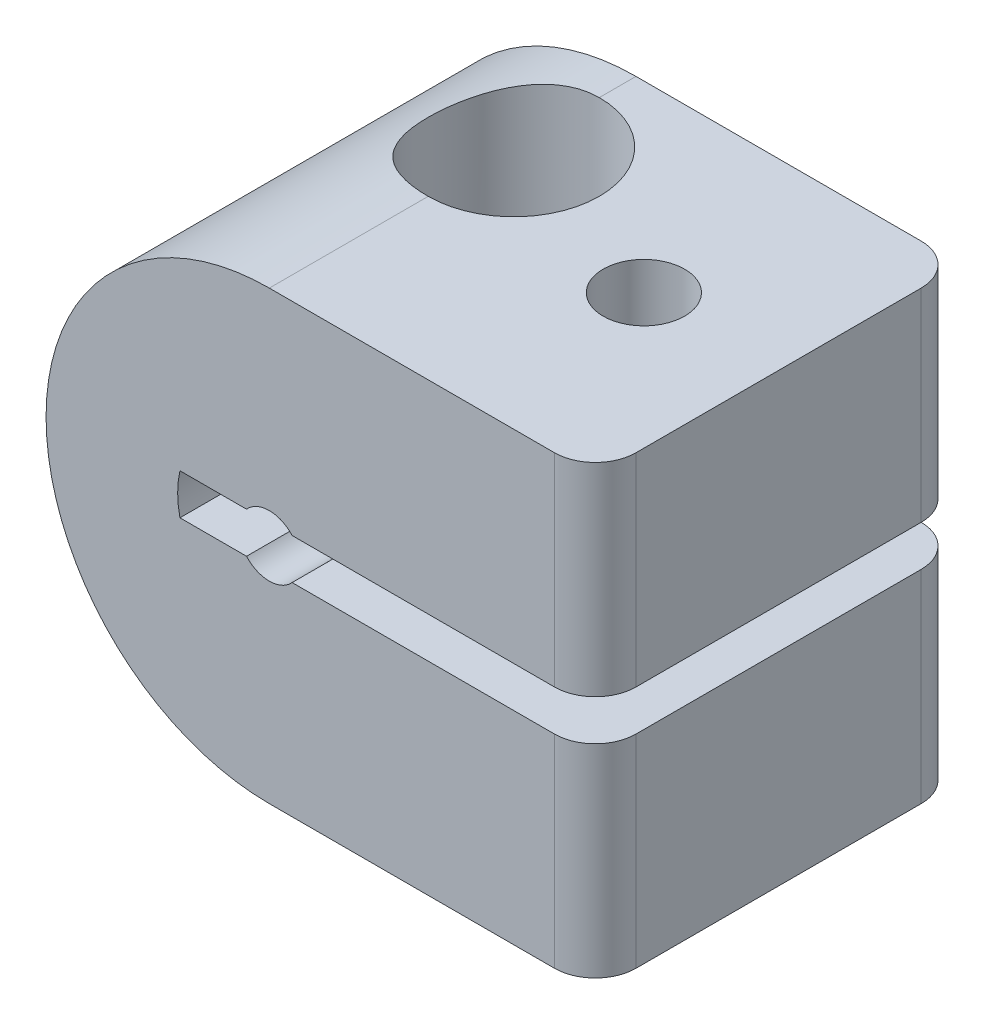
ISO-10303-21;
HEADER;
FILE_DESCRIPTION(('STEP AP214'),'2;1');
FILE_NAME('part.step','',(''),(''),'','','');
FILE_SCHEMA(('AUTOMOTIVE_DESIGN { 1 0 10303 214 1 1 1 1 }'));
ENDSEC;
DATA;
#1=APPLICATION_CONTEXT('core data for automotive mechanical design processes');
#2=APPLICATION_PROTOCOL_DEFINITION('international standard','automotive_design',2000,#1);
#3=PRODUCT_CONTEXT('',#1,'mechanical');
#4=PRODUCT('Part','Part','',(#3));
#5=PRODUCT_RELATED_PRODUCT_CATEGORY('part','',(#4));
#6=PRODUCT_DEFINITION_FORMATION('','',#4);
#7=PRODUCT_DEFINITION_CONTEXT('part definition',#1,'design');
#8=PRODUCT_DEFINITION('design','',#6,#7);
#9=PRODUCT_DEFINITION_SHAPE('','',#8);
#10=(LENGTH_UNIT() NAMED_UNIT(*) SI_UNIT(.MILLI.,.METRE.));
#11=(NAMED_UNIT(*) PLANE_ANGLE_UNIT() SI_UNIT($,.RADIAN.));
#12=(NAMED_UNIT(*) SI_UNIT($,.STERADIAN.) SOLID_ANGLE_UNIT());
#13=UNCERTAINTY_MEASURE_WITH_UNIT(LENGTH_MEASURE(1.E-05),#10,'distance_accuracy_value','');
#14=(GEOMETRIC_REPRESENTATION_CONTEXT(3) GLOBAL_UNCERTAINTY_ASSIGNED_CONTEXT((#13)) GLOBAL_UNIT_ASSIGNED_CONTEXT((#10,
#11,#12)) REPRESENTATION_CONTEXT('',''));
#15=CARTESIAN_POINT('',(0.,0.,0.));
#16=DIRECTION('',(0.,0.,1.));
#17=DIRECTION('',(1.,0.,0.));
#18=AXIS2_PLACEMENT_3D('',#15,#16,#17);
#19=CARTESIAN_POINT('',(0.,0.,-6.35));
#20=DIRECTION('',(0.,0.,-1.));
#21=DIRECTION('',(-1.,0.,0.));
#22=AXIS2_PLACEMENT_3D('',#19,#20,#21);
#23=PLANE('',#22);
#24=DIRECTION('',(0.,-1.,0.));
#25=VECTOR('',#24,1.);
#26=CARTESIAN_POINT('',(8.89,-6.9596,-6.35));
#27=LINE('',#26,#25);
#28=CARTESIAN_POINT('',(8.89,6.9596,-6.35));
#29=VERTEX_POINT('',#28);
#30=CARTESIAN_POINT('',(8.89,0.635,-6.35));
#31=VERTEX_POINT('',#30);
#32=EDGE_CURVE('E204',#29,#31,#27,.T.);
#33=ORIENTED_EDGE('',*,*,#32,.T.);
#34=DIRECTION('',(-1.,0.,0.));
#35=VECTOR('',#34,1.);
#36=CARTESIAN_POINT('',(10.16,0.635,-6.35));
#37=LINE('',#36,#35);
#38=CARTESIAN_POINT('',(2.786051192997,0.634999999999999,-6.35));
#39=VERTEX_POINT('',#38);
#40=EDGE_CURVE('E303',#31,#39,#37,.T.);
#41=ORIENTED_EDGE('',*,*,#40,.T.);
#42=CARTESIAN_POINT('',(0.,0.,-6.35));
#43=DIRECTION('',(0.,0.,1.));
#44=DIRECTION('',(1.,0.,0.));
#45=AXIS2_PLACEMENT_3D('',#42,#43,#44);
#46=CIRCLE('',#45,2.8575);
#47=CARTESIAN_POINT('',(2.786051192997,-0.635000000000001,-6.35));
#48=VERTEX_POINT('',#47);
#49=EDGE_CURVE('E257',#39,#48,#46,.T.);
#50=ORIENTED_EDGE('',*,*,#49,.T.);
#51=DIRECTION('',(1.,0.,0.));
#52=VECTOR('',#51,1.);
#53=CARTESIAN_POINT('',(10.16,-0.635,-6.35));
#54=LINE('',#53,#52);
#55=CARTESIAN_POINT('',(8.89,-0.635,-6.35));
#56=VERTEX_POINT('',#55);
#57=EDGE_CURVE('E299',#48,#56,#54,.T.);
#58=ORIENTED_EDGE('',*,*,#57,.T.);
#59=CARTESIAN_POINT('',(8.89,-6.9596,-6.35));
#60=VERTEX_POINT('',#59);
#61=EDGE_CURVE('E198',#56,#60,#27,.T.);
#62=ORIENTED_EDGE('',*,*,#61,.T.);
#63=DIRECTION('',(-1.,0.,0.));
#64=VECTOR('',#63,1.);
#65=CARTESIAN_POINT('',(0.,-6.9596,-6.35));
#66=LINE('',#65,#64);
#67=CARTESIAN_POINT('',(0.,-6.9596,-6.35));
#68=VERTEX_POINT('',#67);
#69=EDGE_CURVE('E202',#60,#68,#66,.T.);
#70=ORIENTED_EDGE('',*,*,#69,.T.);
#71=CARTESIAN_POINT('',(0.,0.,-6.35));
#72=DIRECTION('',(0.,0.,-1.));
#73=DIRECTION('',(-1.,0.,0.));
#74=AXIS2_PLACEMENT_3D('',#71,#72,#73);
#75=CIRCLE('',#74,6.9596);
#76=CARTESIAN_POINT('',(0.,6.9596,-6.35));
#77=VERTEX_POINT('',#76);
#78=EDGE_CURVE('E254',#68,#77,#75,.T.);
#79=ORIENTED_EDGE('',*,*,#78,.T.);
#80=DIRECTION('',(1.,0.,0.));
#81=VECTOR('',#80,1.);
#82=CARTESIAN_POINT('',(10.16,6.9596,-6.35));
#83=LINE('',#82,#81);
#84=EDGE_CURVE('E182',#77,#29,#83,.T.);
#85=ORIENTED_EDGE('',*,*,#84,.T.);
#86=EDGE_LOOP('',(#33,#41,#50,#58,#62,#70,#79,#85));
#87=FACE_BOUND('',#86,.T.);
#88=ADVANCED_FACE('F34',(#87),#23,.T.);
#89=CARTESIAN_POINT('',(10.16,6.9596,5.08));
#90=DIRECTION('',(-1.,0.,0.));
#91=DIRECTION('',(0.,0.,1.));
#92=AXIS2_PLACEMENT_3D('',#89,#90,#91);
#93=PLANE('',#92);
#94=DIRECTION('',(0.,0.,-1.));
#95=VECTOR('',#94,1.);
#96=CARTESIAN_POINT('',(10.16,0.635,5.08));
#97=LINE('',#96,#95);
#98=CARTESIAN_POINT('',(10.16,0.635,3.81));
#99=VERTEX_POINT('',#98);
#100=CARTESIAN_POINT('',(10.16,0.635,-5.08));
#101=VERTEX_POINT('',#100);
#102=EDGE_CURVE('E288',#99,#101,#97,.T.);
#103=ORIENTED_EDGE('',*,*,#102,.T.);
#104=DIRECTION('',(0.,-1.,0.));
#105=VECTOR('',#104,1.);
#106=CARTESIAN_POINT('',(10.16,6.9596,-5.08));
#107=LINE('',#106,#105);
#108=CARTESIAN_POINT('',(10.16,6.9596,-5.08));
#109=VERTEX_POINT('',#108);
#110=EDGE_CURVE('E215',#101,#109,#107,.F.);
#111=ORIENTED_EDGE('',*,*,#110,.T.);
#112=DIRECTION('',(0.,0.,-1.));
#113=VECTOR('',#112,1.);
#114=CARTESIAN_POINT('',(10.16,6.9596,5.08));
#115=LINE('',#114,#113);
#116=CARTESIAN_POINT('',(10.16,6.9596,3.81));
#117=VERTEX_POINT('',#116);
#118=EDGE_CURVE('E185',#117,#109,#115,.T.);
#119=ORIENTED_EDGE('',*,*,#118,.F.);
#120=DIRECTION('',(0.,1.,0.));
#121=VECTOR('',#120,1.);
#122=CARTESIAN_POINT('',(10.16,-6.9596,3.81));
#123=LINE('',#122,#121);
#124=EDGE_CURVE('E212',#117,#99,#123,.F.);
#125=ORIENTED_EDGE('',*,*,#124,.T.);
#126=EDGE_LOOP('',(#103,#111,#119,#125));
#127=FACE_BOUND('',#126,.T.);
#128=ADVANCED_FACE('F366',(#127),#93,.F.);
#129=DIRECTION('',(0.,0.,-1.));
#130=VECTOR('',#129,1.);
#131=CARTESIAN_POINT('',(10.16,-0.635,5.08));
#132=LINE('',#131,#130);
#133=CARTESIAN_POINT('',(10.16,-0.635,3.81));
#134=VERTEX_POINT('',#133);
#135=CARTESIAN_POINT('',(10.16,-0.635,-5.08));
#136=VERTEX_POINT('',#135);
#137=EDGE_CURVE('E296',#134,#136,#132,.T.);
#138=ORIENTED_EDGE('',*,*,#137,.F.);
#139=CARTESIAN_POINT('',(10.16,-6.9596,3.81));
#140=VERTEX_POINT('',#139);
#141=EDGE_CURVE('E211',#134,#140,#123,.F.);
#142=ORIENTED_EDGE('',*,*,#141,.T.);
#143=DIRECTION('',(0.,0.,-1.));
#144=VECTOR('',#143,1.);
#145=CARTESIAN_POINT('',(10.16,-6.9596,5.08));
#146=LINE('',#145,#144);
#147=CARTESIAN_POINT('',(10.16,-6.9596,-5.08));
#148=VERTEX_POINT('',#147);
#149=EDGE_CURVE('E192',#140,#148,#146,.T.);
#150=ORIENTED_EDGE('',*,*,#149,.T.);
#151=EDGE_CURVE('E216',#148,#136,#107,.F.);
#152=ORIENTED_EDGE('',*,*,#151,.T.);
#153=EDGE_LOOP('',(#138,#142,#150,#152));
#154=FACE_BOUND('',#153,.T.);
#155=ADVANCED_FACE('F371',(#154),#93,.F.);
#156=CARTESIAN_POINT('',(0.,0.,5.08));
#157=DIRECTION('',(0.,0.,1.));
#158=DIRECTION('',(1.,0.,0.));
#159=AXIS2_PLACEMENT_3D('',#156,#157,#158);
#160=PLANE('',#159);
#161=CARTESIAN_POINT('',(0.,0.,5.08));
#162=DIRECTION('',(0.,0.,1.));
#163=DIRECTION('',(1.,0.,0.));
#164=AXIS2_PLACEMENT_3D('',#161,#162,#163);
#165=CIRCLE('',#164,0.9525);
#166=CARTESIAN_POINT('',(0.709951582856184,0.634999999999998,5.08));
#167=VERTEX_POINT('',#166);
#168=CARTESIAN_POINT('',(-0.709951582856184,0.634999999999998,5.08));
#169=VERTEX_POINT('',#168);
#170=EDGE_CURVE('E247',#167,#169,#165,.T.);
#171=ORIENTED_EDGE('',*,*,#170,.F.);
#172=DIRECTION('',(-1.,0.,0.));
#173=VECTOR('',#172,1.);
#174=CARTESIAN_POINT('',(10.16,0.635,5.08));
#175=LINE('',#174,#173);
#176=CARTESIAN_POINT('',(8.89,0.635,5.08));
#177=VERTEX_POINT('',#176);
#178=EDGE_CURVE('E310',#177,#167,#175,.T.);
#179=ORIENTED_EDGE('',*,*,#178,.F.);
#180=DIRECTION('',(0.,1.,0.));
#181=VECTOR('',#180,1.);
#182=CARTESIAN_POINT('',(8.89,6.9596,5.08));
#183=LINE('',#182,#181);
#184=CARTESIAN_POINT('',(8.89,6.9596,5.08));
#185=VERTEX_POINT('',#184);
#186=EDGE_CURVE('E223',#177,#185,#183,.T.);
#187=ORIENTED_EDGE('',*,*,#186,.T.);
#188=DIRECTION('',(-1.,0.,0.));
#189=VECTOR('',#188,1.);
#190=CARTESIAN_POINT('',(0.,6.9596,5.08));
#191=LINE('',#190,#189);
#192=CARTESIAN_POINT('',(0.,6.9596,5.08));
#193=VERTEX_POINT('',#192);
#194=EDGE_CURVE('E183',#185,#193,#191,.T.);
#195=ORIENTED_EDGE('',*,*,#194,.T.);
#196=CARTESIAN_POINT('',(0.,0.,5.08));
#197=DIRECTION('',(0.,0.,1.));
#198=DIRECTION('',(1.,0.,0.));
#199=AXIS2_PLACEMENT_3D('',#196,#197,#198);
#200=CIRCLE('',#199,6.9596);
#201=CARTESIAN_POINT('',(0.,-6.9596,5.08));
#202=VERTEX_POINT('',#201);
#203=EDGE_CURVE('E244',#193,#202,#200,.T.);
#204=ORIENTED_EDGE('',*,*,#203,.T.);
#205=DIRECTION('',(1.,0.,0.));
#206=VECTOR('',#205,1.);
#207=CARTESIAN_POINT('',(0.,-6.9596,5.08));
#208=LINE('',#207,#206);
#209=CARTESIAN_POINT('',(8.89,-6.9596,5.08));
#210=VERTEX_POINT('',#209);
#211=EDGE_CURVE('E186',#202,#210,#208,.T.);
#212=ORIENTED_EDGE('',*,*,#211,.T.);
#213=CARTESIAN_POINT('',(8.89,-0.635,5.08));
#214=VERTEX_POINT('',#213);
#215=EDGE_CURVE('E224',#210,#214,#183,.T.);
#216=ORIENTED_EDGE('',*,*,#215,.T.);
#217=DIRECTION('',(1.,0.,0.));
#218=VECTOR('',#217,1.);
#219=CARTESIAN_POINT('',(10.16,-0.635,5.08));
#220=LINE('',#219,#218);
#221=CARTESIAN_POINT('',(0.709951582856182,-0.635000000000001,5.08));
#222=VERTEX_POINT('',#221);
#223=EDGE_CURVE('E241',#222,#214,#220,.T.);
#224=ORIENTED_EDGE('',*,*,#223,.F.);
#225=CARTESIAN_POINT('',(-0.709951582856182,-0.635000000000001,5.08));
#226=VERTEX_POINT('',#225);
#227=EDGE_CURVE('E252',#226,#222,#165,.T.);
#228=ORIENTED_EDGE('',*,*,#227,.F.);
#229=CARTESIAN_POINT('',(-2.786051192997,-0.635000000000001,5.08));
#230=VERTEX_POINT('',#229);
#231=EDGE_CURVE('E298',#230,#226,#220,.T.);
#232=ORIENTED_EDGE('',*,*,#231,.F.);
#233=CARTESIAN_POINT('',(0.,0.,5.08));
#234=DIRECTION('',(0.,0.,1.));
#235=DIRECTION('',(1.,0.,0.));
#236=AXIS2_PLACEMENT_3D('',#233,#234,#235);
#237=CIRCLE('',#236,2.8575);
#238=CARTESIAN_POINT('',(-2.786051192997,0.634999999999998,5.08));
#239=VERTEX_POINT('',#238);
#240=EDGE_CURVE('E308',#239,#230,#237,.T.);
#241=ORIENTED_EDGE('',*,*,#240,.F.);
#242=EDGE_CURVE('E302',#169,#239,#175,.T.);
#243=ORIENTED_EDGE('',*,*,#242,.F.);
#244=EDGE_LOOP('',(#171,#179,#187,#195,#204,#212,#216,#224,#228,#232,#241,#243));
#245=FACE_BOUND('',#244,.T.);
#246=ADVANCED_FACE('F239',(#245),#160,.T.);
#247=CARTESIAN_POINT('',(0.,0.,-3.81));
#248=DIRECTION('',(0.,0.,1.));
#249=DIRECTION('',(1.,0.,0.));
#250=AXIS2_PLACEMENT_3D('',#247,#248,#249);
#251=CYLINDRICAL_SURFACE('',#250,0.9525);
#252=DIRECTION('',(0.,0.,1.));
#253=VECTOR('',#252,1.);
#254=CARTESIAN_POINT('',(0.709951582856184,0.634999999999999,-3.81));
#255=LINE('',#254,#253);
#256=CARTESIAN_POINT('',(0.709951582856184,0.634999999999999,1.27));
#257=VERTEX_POINT('',#256);
#258=EDGE_CURVE('E266',#167,#257,#255,.F.);
#259=ORIENTED_EDGE('',*,*,#258,.F.);
#260=ORIENTED_EDGE('',*,*,#170,.T.);
#261=DIRECTION('',(0.,0.,1.));
#262=VECTOR('',#261,1.);
#263=CARTESIAN_POINT('',(-0.709951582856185,0.634999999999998,-3.81));
#264=LINE('',#263,#262);
#265=CARTESIAN_POINT('',(-0.709951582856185,0.634999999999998,1.27));
#266=VERTEX_POINT('',#265);
#267=EDGE_CURVE('E260',#266,#169,#264,.T.);
#268=ORIENTED_EDGE('',*,*,#267,.F.);
#269=CARTESIAN_POINT('',(0.,0.,1.27));
#270=DIRECTION('',(0.,0.,1.));
#271=DIRECTION('',(1.,0.,0.));
#272=AXIS2_PLACEMENT_3D('',#269,#270,#271);
#273=CIRCLE('',#272,0.9525);
#274=EDGE_CURVE('E203',#266,#257,#273,.F.);
#275=ORIENTED_EDGE('',*,*,#274,.T.);
#276=EDGE_LOOP('',(#259,#260,#268,#275));
#277=FACE_BOUND('',#276,.T.);
#278=ADVANCED_FACE('F361',(#277),#251,.F.);
#279=DIRECTION('',(0.,0.,1.));
#280=VECTOR('',#279,1.);
#281=CARTESIAN_POINT('',(-0.709951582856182,-0.635000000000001,-3.81));
#282=LINE('',#281,#280);
#283=CARTESIAN_POINT('',(-0.709951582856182,-0.635000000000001,1.27));
#284=VERTEX_POINT('',#283);
#285=EDGE_CURVE('E57',#226,#284,#282,.F.);
#286=ORIENTED_EDGE('',*,*,#285,.F.);
#287=ORIENTED_EDGE('',*,*,#227,.T.);
#288=DIRECTION('',(0.,0.,1.));
#289=VECTOR('',#288,1.);
#290=CARTESIAN_POINT('',(0.709951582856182,-0.635000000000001,-3.81));
#291=LINE('',#290,#289);
#292=CARTESIAN_POINT('',(0.709951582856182,-0.635000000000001,1.27));
#293=VERTEX_POINT('',#292);
#294=EDGE_CURVE('E278',#293,#222,#291,.T.);
#295=ORIENTED_EDGE('',*,*,#294,.F.);
#296=EDGE_CURVE('E199',#293,#284,#273,.F.);
#297=ORIENTED_EDGE('',*,*,#296,.T.);
#298=EDGE_LOOP('',(#286,#287,#295,#297));
#299=FACE_BOUND('',#298,.T.);
#300=ADVANCED_FACE('F354',(#299),#251,.F.);
#301=CARTESIAN_POINT('',(0.,0.,1.27));
#302=DIRECTION('',(0.,0.,1.));
#303=DIRECTION('',(1.,0.,0.));
#304=AXIS2_PLACEMENT_3D('',#301,#302,#303);
#305=PLANE('',#304);
#306=DIRECTION('',(1.,0.,0.));
#307=VECTOR('',#306,1.);
#308=CARTESIAN_POINT('',(0.,0.634999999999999,1.27));
#309=LINE('',#308,#307);
#310=CARTESIAN_POINT('',(-2.786051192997,0.634999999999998,1.27));
#311=VERTEX_POINT('',#310);
#312=EDGE_CURVE('E265',#311,#266,#309,.T.);
#313=ORIENTED_EDGE('',*,*,#312,.F.);
#314=CARTESIAN_POINT('',(0.,0.,1.27));
#315=DIRECTION('',(0.,0.,1.));
#316=DIRECTION('',(1.,0.,0.));
#317=AXIS2_PLACEMENT_3D('',#314,#315,#316);
#318=CIRCLE('',#317,2.8575);
#319=CARTESIAN_POINT('',(2.786051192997,0.634999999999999,1.27));
#320=VERTEX_POINT('',#319);
#321=EDGE_CURVE('E261',#320,#311,#318,.T.);
#322=ORIENTED_EDGE('',*,*,#321,.F.);
#323=EDGE_CURVE('E268',#257,#320,#309,.T.);
#324=ORIENTED_EDGE('',*,*,#323,.F.);
#325=ORIENTED_EDGE('',*,*,#274,.F.);
#326=EDGE_LOOP('',(#313,#322,#324,#325));
#327=FACE_BOUND('',#326,.T.);
#328=ADVANCED_FACE('F351',(#327),#305,.F.);
#329=DIRECTION('',(-1.,0.,0.));
#330=VECTOR('',#329,1.);
#331=CARTESIAN_POINT('',(0.,-0.635000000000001,1.27));
#332=LINE('',#331,#330);
#333=CARTESIAN_POINT('',(2.786051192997,-0.635000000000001,1.27));
#334=VERTEX_POINT('',#333);
#335=EDGE_CURVE('E280',#334,#293,#332,.T.);
#336=ORIENTED_EDGE('',*,*,#335,.F.);
#337=CARTESIAN_POINT('',(-2.786051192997,-0.635000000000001,1.27));
#338=VERTEX_POINT('',#337);
#339=EDGE_CURVE('E259',#338,#334,#318,.T.);
#340=ORIENTED_EDGE('',*,*,#339,.F.);
#341=EDGE_CURVE('E277',#284,#338,#332,.T.);
#342=ORIENTED_EDGE('',*,*,#341,.F.);
#343=ORIENTED_EDGE('',*,*,#296,.F.);
#344=EDGE_LOOP('',(#336,#340,#342,#343));
#345=FACE_BOUND('',#344,.T.);
#346=ADVANCED_FACE('F353',(#345),#305,.F.);
#347=CARTESIAN_POINT('',(0.,0.,1.27));
#348=DIRECTION('',(0.,0.,-1.));
#349=DIRECTION('',(-1.,0.,0.));
#350=AXIS2_PLACEMENT_3D('',#347,#348,#349);
#351=CYLINDRICAL_SURFACE('',#350,2.8575);
#352=CARTESIAN_POINT('',(0.,2.8575,0.127));
#353=CARTESIAN_POINT('',(-0.122100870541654,2.85749625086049,0.126996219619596));
#354=CARTESIAN_POINT('',(-0.244227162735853,2.84960899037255,0.118550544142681));
#355=CARTESIAN_POINT('',(-0.484311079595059,2.81876441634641,0.0854619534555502));
#356=CARTESIAN_POINT('',(-0.602265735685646,2.79579659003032,0.0608077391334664));
#357=CARTESIAN_POINT('',(-0.829920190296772,2.73684010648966,-0.00267580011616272));
#358=CARTESIAN_POINT('',(-0.939667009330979,2.70093379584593,-0.0414154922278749));
#359=CARTESIAN_POINT('',(-1.14975486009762,2.61842154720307,-0.13084854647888));
#360=CARTESIAN_POINT('',(-1.25009359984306,2.57181301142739,-0.18154481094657));
#361=CARTESIAN_POINT('',(-1.47901233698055,2.44965163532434,-0.315276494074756));
#362=CARTESIAN_POINT('',(-1.60260758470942,2.37001541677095,-0.403099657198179));
#363=CARTESIAN_POINT('',(-1.82941345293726,2.19971728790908,-0.593667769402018));
#364=CARTESIAN_POINT('',(-1.93255466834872,2.10901946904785,-0.696461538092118));
#365=CARTESIAN_POINT('',(-2.08425279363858,1.9565526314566,-0.873603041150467));
#366=CARTESIAN_POINT('',(-2.13887389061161,1.89651749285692,-0.94437715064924));
#367=CARTESIAN_POINT('',(-2.2404660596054,1.7753494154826,-1.09047299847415));
#368=CARTESIAN_POINT('',(-2.2874314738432,1.71421570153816,-1.165798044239));
#369=CARTESIAN_POINT('',(-2.37369166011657,1.59261906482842,-1.32084753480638));
#370=CARTESIAN_POINT('',(-2.41300565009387,1.53215483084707,-1.40056029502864));
#371=CARTESIAN_POINT('',(-2.48407168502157,1.41400515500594,-1.56515742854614));
#372=CARTESIAN_POINT('',(-2.51583383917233,1.35631608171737,-1.65003469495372));
#373=CARTESIAN_POINT('',(-2.56333683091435,1.26352310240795,-1.80075810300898));
#374=CARTESIAN_POINT('',(-2.58104864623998,1.22673906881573,-1.86493553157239));
#375=CARTESIAN_POINT('',(-2.61210624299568,1.15912918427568,-1.99740347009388));
#376=CARTESIAN_POINT('',(-2.62545748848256,1.12829589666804,-2.06568870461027));
#377=CARTESIAN_POINT('',(-2.64491717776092,1.08177249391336,-2.19277992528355));
#378=CARTESIAN_POINT('',(-2.65193861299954,1.06428932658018,-2.2507644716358));
#379=CARTESIAN_POINT('',(-2.66216905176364,1.03844334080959,-2.36900097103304));
#380=CARTESIAN_POINT('',(-2.66538935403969,1.03005349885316,-2.42924565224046));
#381=CARTESIAN_POINT('',(-2.66767388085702,1.02412799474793,-2.5507913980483));
#382=CARTESIAN_POINT('',(-2.66671013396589,1.02666538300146,-2.6120968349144));
#383=CARTESIAN_POINT('',(-2.66068768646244,1.04216458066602,-2.73321158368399));
#384=CARTESIAN_POINT('',(-2.65561939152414,1.05515081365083,-2.79301705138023));
#385=CARTESIAN_POINT('',(-2.6388396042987,1.09658801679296,-2.93579509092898));
#386=CARTESIAN_POINT('',(-2.6251751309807,1.12934994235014,-3.01722829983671));
#387=CARTESIAN_POINT('',(-2.59170223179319,1.20419149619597,-3.17441325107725));
#388=CARTESIAN_POINT('',(-2.57186698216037,1.24631157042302,-3.25013836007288));
#389=CARTESIAN_POINT('',(-2.5251205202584,1.33863669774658,-3.40221762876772));
#390=CARTESIAN_POINT('',(-2.49780056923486,1.38920651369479,-3.47821938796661));
#391=CARTESIAN_POINT('',(-2.43719477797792,1.49298812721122,-3.6259784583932));
#392=CARTESIAN_POINT('',(-2.40390321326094,1.54620242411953,-3.69773160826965));
#393=CARTESIAN_POINT('',(-2.33137179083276,1.65354688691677,-3.83761493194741));
#394=CARTESIAN_POINT('',(-2.2921241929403,1.70767816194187,-3.90574023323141));
#395=CARTESIAN_POINT('',(-2.2076365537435,1.81558427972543,-4.03847156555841));
#396=CARTESIAN_POINT('',(-2.16239629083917,1.86935910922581,-4.1030774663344));
#397=CARTESIAN_POINT('',(-2.06172471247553,1.98006464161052,-4.23397670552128));
#398=CARTESIAN_POINT('',(-2.00575663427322,2.03688116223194,-4.29995617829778));
#399=CARTESIAN_POINT('',(-1.88639849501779,2.14789523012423,-4.42732835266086));
#400=CARTESIAN_POINT('',(-1.82300600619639,2.20209191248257,-4.48871954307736));
#401=CARTESIAN_POINT('',(-1.68888807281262,2.3065470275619,-4.6060228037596));
#402=CARTESIAN_POINT('',(-1.61819012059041,2.35681905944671,-4.66195397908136));
#403=CARTESIAN_POINT('',(-1.46926741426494,2.4524252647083,-4.76766232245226));
#404=CARTESIAN_POINT('',(-1.39104495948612,2.49776093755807,-4.81744135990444));
#405=CARTESIAN_POINT('',(-1.20901660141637,2.59157265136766,-4.9199897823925));
#406=CARTESIAN_POINT('',(-1.10338324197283,2.63851719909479,-4.97097609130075));
#407=CARTESIAN_POINT('',(-0.882310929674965,2.7204233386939,-5.05963747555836));
#408=CARTESIAN_POINT('',(-0.76687899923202,2.75539342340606,-5.09732198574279));
#409=CARTESIAN_POINT('',(-0.5276570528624,2.81105983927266,-5.15720533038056));
#410=CARTESIAN_POINT('',(-0.403809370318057,2.83164384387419,-5.17928231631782));
#411=CARTESIAN_POINT('',(-0.152620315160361,2.85620382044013,-5.20561561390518));
#412=CARTESIAN_POINT('',(-0.0252812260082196,2.86019039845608,-5.20988330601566));
#413=CARTESIAN_POINT('',(0.213499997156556,2.8517270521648,-5.20081387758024));
#414=CARTESIAN_POINT('',(0.325092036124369,2.8411078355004,-5.1894376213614));
#415=CARTESIAN_POINT('',(0.544113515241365,2.80740583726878,-5.15326488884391));
#416=CARTESIAN_POINT('',(0.651542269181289,2.78432101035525,-5.1284662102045));
#417=CARTESIAN_POINT('',(0.861192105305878,2.72683695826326,-5.0665306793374));
#418=CARTESIAN_POINT('',(0.96332428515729,2.69229049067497,-5.02923319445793));
#419=CARTESIAN_POINT('',(1.15927902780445,2.6139115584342,-4.94424319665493));
#420=CARTESIAN_POINT('',(1.25309938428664,2.57007663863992,-4.89654793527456));
#421=CARTESIAN_POINT('',(1.476194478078,2.45134825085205,-4.7665902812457));
#422=CARTESIAN_POINT('',(1.59988594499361,2.37185272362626,-4.67893577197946));
#423=CARTESIAN_POINT('',(1.8269195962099,2.20179234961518,-4.48867484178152));
#424=CARTESIAN_POINT('',(1.93018744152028,2.11118894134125,-4.38601608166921));
#425=CARTESIAN_POINT('',(2.08213397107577,1.95881021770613,-4.20904584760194));
#426=CARTESIAN_POINT('',(2.13686959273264,1.89877856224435,-4.13830789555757));
#427=CARTESIAN_POINT('',(2.2386834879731,1.77760012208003,-3.99228077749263));
#428=CARTESIAN_POINT('',(2.28575610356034,1.71645255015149,-3.9169883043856));
#429=CARTESIAN_POINT('',(2.37222273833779,1.59480976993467,-3.76200941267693));
#430=CARTESIAN_POINT('',(2.41163636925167,1.53431328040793,-3.68233490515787));
#431=CARTESIAN_POINT('',(2.48289982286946,1.41606644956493,-3.51782344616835));
#432=CARTESIAN_POINT('',(2.51475967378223,1.35831254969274,-3.43299352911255));
#433=CARTESIAN_POINT('',(2.56244974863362,1.26532551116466,-3.28231435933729));
#434=CARTESIAN_POINT('',(2.58024657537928,1.22842990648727,-3.21812635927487));
#435=CARTESIAN_POINT('',(2.61147369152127,1.1605585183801,-3.0856369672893));
#436=CARTESIAN_POINT('',(2.62490921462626,1.12957565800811,-3.01734062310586));
#437=CARTESIAN_POINT('',(2.64453343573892,1.08271404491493,-2.89014661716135));
#438=CARTESIAN_POINT('',(2.65163063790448,1.06505880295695,-2.83206880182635));
#439=CARTESIAN_POINT('',(2.66200198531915,1.03887401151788,-2.71361829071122));
#440=CARTESIAN_POINT('',(2.66528758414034,1.03031712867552,-2.65325303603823));
#441=CARTESIAN_POINT('',(2.66768528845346,1.02409894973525,-2.53141978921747));
#442=CARTESIAN_POINT('',(2.66676846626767,1.02651317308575,-2.46994706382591));
#443=CARTESIAN_POINT('',(2.66081440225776,1.04184021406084,-2.34848674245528));
#444=CARTESIAN_POINT('',(2.65576751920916,1.05477759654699,-2.28850296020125));
#445=CARTESIAN_POINT('',(2.63906130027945,1.09605056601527,-2.14572396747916));
#446=CARTESIAN_POINT('',(2.62547392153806,1.12864861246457,-2.06444491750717));
#447=CARTESIAN_POINT('',(2.59217663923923,1.20316349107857,-1.90754832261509));
#448=CARTESIAN_POINT('',(2.57244004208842,1.2451207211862,-1.83195728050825));
#449=CARTESIAN_POINT('',(2.52591517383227,1.33712892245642,-1.68012717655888));
#450=CARTESIAN_POINT('',(2.49871840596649,1.38754662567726,-1.60424090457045));
#451=CARTESIAN_POINT('',(2.43838312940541,1.49103869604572,-1.45670376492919));
#452=CARTESIAN_POINT('',(2.40523890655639,1.54411558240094,-1.38505705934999));
#453=CARTESIAN_POINT('',(2.33302834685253,1.65120106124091,-1.24537574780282));
#454=CARTESIAN_POINT('',(2.29395428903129,1.70521078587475,-1.17734600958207));
#455=CARTESIAN_POINT('',(2.20984156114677,1.81289210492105,-1.04479133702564));
#456=CARTESIAN_POINT('',(2.16480265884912,1.86656368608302,-0.980266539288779));
#457=CARTESIAN_POINT('',(2.0645290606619,1.97713445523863,-0.849448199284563));
#458=CARTESIAN_POINT('',(2.00875297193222,2.03391984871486,-0.783471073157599));
#459=CARTESIAN_POINT('',(1.88979964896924,2.14489726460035,-0.65608342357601));
#460=CARTESIAN_POINT('',(1.82661998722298,2.19908842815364,-0.594674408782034));
#461=CARTESIAN_POINT('',(1.69294079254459,2.30356823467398,-0.477302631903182));
#462=CARTESIAN_POINT('',(1.62246794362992,2.35387000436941,-0.421321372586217));
#463=CARTESIAN_POINT('',(1.47400988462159,2.44957147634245,-0.315479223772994));
#464=CARTESIAN_POINT('',(1.39602698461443,2.4949726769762,-0.26561646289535));
#465=CARTESIAN_POINT('',(1.21426622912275,2.5891219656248,-0.162677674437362));
#466=CARTESIAN_POINT('',(1.10863309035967,2.63632338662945,-0.111404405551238));
#467=CARTESIAN_POINT('',(0.887534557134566,2.71872468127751,-0.0221958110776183));
#468=CARTESIAN_POINT('',(0.772081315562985,2.75393912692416,0.0157557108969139));
#469=CARTESIAN_POINT('',(0.548073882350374,2.80651337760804,0.0723159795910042));
#470=CARTESIAN_POINT('',(0.440357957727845,2.82551028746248,0.0927011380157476));
#471=CARTESIAN_POINT('',(0.221767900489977,2.85100399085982,0.120043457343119));
#472=CARTESIAN_POINT('',(0.110894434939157,2.85750340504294,0.127003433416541));
#473=CARTESIAN_POINT('',(0.,2.8575,0.127));
#474=B_SPLINE_CURVE_WITH_KNOTS('',3,(#352,#353,#354,#355,#356,#357,#358,#359,#360,#361,#362,
#363,#364,#365,#366,#367,#368,#369,#370,#371,#372,#373,#374,#375,#376,#377,#378,#379,#380,#381,
#382,#383,#384,#385,#386,#387,#388,#389,#390,#391,#392,#393,#394,#395,#396,#397,#398,#399,#400,
#401,#402,#403,#404,#405,#406,#407,#408,#409,#410,#411,#412,#413,#414,#415,#416,#417,#418,#419,
#420,#421,#422,#423,#424,#425,#426,#427,#428,#429,#430,#431,#432,#433,#434,#435,#436,#437,#438,
#439,#440,#441,#442,#443,#444,#445,#446,#447,#448,#449,#450,#451,#452,#453,#454,#455,#456,#457,
#458,#459,#460,#461,#462,#463,#464,#465,#466,#467,#468,#469,#470,#471,#472,#473),.UNSPECIFIED.,
.T.,.F.,(4,2,2,2,2,2,2,2,2,2,2,2,2,2,2,2,2,2,2,2,2,2,2,2,2,2,2,2,2,2,2,2,2,2,2,2,2,2,2,2,2,2,2,
2,2,2,2,2,2,2,2,2,2,2,2,2,2,2,2,2,4),(0.,0.36582666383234,0.731908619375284,1.09570065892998,
1.45958109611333,1.9705885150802,2.48330129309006,2.80602869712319,3.12899353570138,
3.45113641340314,3.77284559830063,4.00073353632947,4.22833481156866,4.41059657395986,
4.59231519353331,4.77525051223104,4.9586146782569,5.22361093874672,5.48977559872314,
5.77523659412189,6.06097271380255,6.34708339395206,6.63320465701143,6.94335233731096,
7.25360171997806,7.56272336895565,7.8717508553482,8.24927924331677,8.6265393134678,
9.00671307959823,9.38664387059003,9.72304827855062,10.0595079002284,10.4004689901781,
10.7415203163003,11.2522488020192,11.7648033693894,12.0876263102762,12.4106865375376,
12.7329083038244,13.0546998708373,13.2828379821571,13.5107012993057,13.6934051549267,
13.8755585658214,14.0589677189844,14.2428062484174,14.507166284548,14.7726902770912,
15.0575276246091,15.3426401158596,15.6281270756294,15.9136251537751,16.2234081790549,
16.5332930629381,16.8420817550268,17.1507757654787,17.5289490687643,17.9066609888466,
18.2389817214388,18.5712327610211),.UNSPECIFIED.);
#475=CARTESIAN_POINT('',(0.,2.8575,0.127));
#476=VERTEX_POINT('',#475);
#477=EDGE_CURVE('E177',#476,#476,#474,.T.);
#478=ORIENTED_EDGE('',*,*,#477,.F.);
#479=EDGE_LOOP('',(#478));
#480=FACE_BOUND('',#479,.T.);
#481=ORIENTED_EDGE('',*,*,#339,.T.);
#482=DIRECTION('',(0.,0.,-1.));
#483=VECTOR('',#482,1.);
#484=CARTESIAN_POINT('',(2.786051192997,-0.635000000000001,1.27));
#485=LINE('',#484,#483);
#486=EDGE_CURVE('E282',#334,#48,#485,.T.);
#487=ORIENTED_EDGE('',*,*,#486,.T.);
#488=ORIENTED_EDGE('',*,*,#49,.F.);
#489=DIRECTION('',(0.,0.,-1.));
#490=VECTOR('',#489,1.);
#491=CARTESIAN_POINT('',(2.786051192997,0.634999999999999,1.27));
#492=LINE('',#491,#490);
#493=EDGE_CURVE('E270',#39,#320,#492,.F.);
#494=ORIENTED_EDGE('',*,*,#493,.T.);
#495=ORIENTED_EDGE('',*,*,#321,.T.);
#496=DIRECTION('',(0.,0.,-1.));
#497=VECTOR('',#496,1.);
#498=CARTESIAN_POINT('',(-2.786051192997,0.634999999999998,5.08));
#499=LINE('',#498,#497);
#500=EDGE_CURVE('E291',#239,#311,#499,.T.);
#501=ORIENTED_EDGE('',*,*,#500,.F.);
#502=ORIENTED_EDGE('',*,*,#240,.T.);
#503=DIRECTION('',(0.,0.,-1.));
#504=VECTOR('',#503,1.);
#505=CARTESIAN_POINT('',(-2.786051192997,-0.635000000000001,5.08));
#506=LINE('',#505,#504);
#507=EDGE_CURVE('E293',#230,#338,#506,.T.);
#508=ORIENTED_EDGE('',*,*,#507,.T.);
#509=EDGE_LOOP('',(#481,#487,#488,#494,#495,#501,#502,#508));
#510=FACE_BOUND('',#509,.T.);
#511=ADVANCED_FACE('F329',(#480,#510),#351,.F.);
#512=CARTESIAN_POINT('',(8.89,0.,-5.08));
#513=DIRECTION('',(0.,1.,0.));
#514=DIRECTION('',(0.,0.,1.));
#515=AXIS2_PLACEMENT_3D('',#512,#513,#514);
#516=CYLINDRICAL_SURFACE('',#515,1.27);
#517=ORIENTED_EDGE('',*,*,#110,.F.);
#518=CARTESIAN_POINT('',(8.89,0.635,-5.08));
#519=DIRECTION('',(0.,-1.,0.));
#520=DIRECTION('',(1.,0.,0.));
#521=AXIS2_PLACEMENT_3D('',#518,#519,#520);
#522=CIRCLE('',#521,1.27);
#523=EDGE_CURVE('E273',#101,#31,#522,.F.);
#524=ORIENTED_EDGE('',*,*,#523,.T.);
#525=ORIENTED_EDGE('',*,*,#32,.F.);
#526=CARTESIAN_POINT('',(8.89,6.9596,-5.08));
#527=DIRECTION('',(0.,-1.,0.));
#528=DIRECTION('',(0.,0.,-1.));
#529=AXIS2_PLACEMENT_3D('',#526,#527,#528);
#530=CIRCLE('',#529,1.27);
#531=EDGE_CURVE('E221',#109,#29,#530,.F.);
#532=ORIENTED_EDGE('',*,*,#531,.F.);
#533=EDGE_LOOP('',(#517,#524,#525,#532));
#534=FACE_BOUND('',#533,.T.);
#535=ADVANCED_FACE('F387',(#534),#516,.T.);
#536=ORIENTED_EDGE('',*,*,#61,.F.);
#537=CARTESIAN_POINT('',(8.89,-0.635,-5.08));
#538=DIRECTION('',(0.,1.,0.));
#539=DIRECTION('',(-1.,0.,0.));
#540=AXIS2_PLACEMENT_3D('',#537,#538,#539);
#541=CIRCLE('',#540,1.27);
#542=EDGE_CURVE('E285',#56,#136,#541,.F.);
#543=ORIENTED_EDGE('',*,*,#542,.T.);
#544=ORIENTED_EDGE('',*,*,#151,.F.);
#545=CARTESIAN_POINT('',(8.89,-6.9596,-5.08));
#546=DIRECTION('',(0.,1.,0.));
#547=DIRECTION('',(0.,0.,1.));
#548=AXIS2_PLACEMENT_3D('',#545,#546,#547);
#549=CIRCLE('',#548,1.27);
#550=EDGE_CURVE('E209',#60,#148,#549,.F.);
#551=ORIENTED_EDGE('',*,*,#550,.F.);
#552=EDGE_LOOP('',(#536,#543,#544,#551));
#553=FACE_BOUND('',#552,.T.);
#554=ADVANCED_FACE('F389',(#553),#516,.T.);
#555=CARTESIAN_POINT('',(8.89,0.,3.81));
#556=DIRECTION('',(0.,-1.,0.));
#557=DIRECTION('',(0.,0.,-1.));
#558=AXIS2_PLACEMENT_3D('',#555,#556,#557);
#559=CYLINDRICAL_SURFACE('',#558,1.27);
#560=ORIENTED_EDGE('',*,*,#186,.F.);
#561=CARTESIAN_POINT('',(8.89,0.635,3.81));
#562=DIRECTION('',(0.,-1.,0.));
#563=DIRECTION('',(1.,0.,0.));
#564=AXIS2_PLACEMENT_3D('',#561,#562,#563);
#565=CIRCLE('',#564,1.27);
#566=EDGE_CURVE('E12',#177,#99,#565,.F.);
#567=ORIENTED_EDGE('',*,*,#566,.T.);
#568=ORIENTED_EDGE('',*,*,#124,.F.);
#569=CARTESIAN_POINT('',(8.89,6.9596,3.81));
#570=DIRECTION('',(0.,-1.,0.));
#571=DIRECTION('',(0.,0.,-1.));
#572=AXIS2_PLACEMENT_3D('',#569,#570,#571);
#573=CIRCLE('',#572,1.27);
#574=EDGE_CURVE('E219',#185,#117,#573,.F.);
#575=ORIENTED_EDGE('',*,*,#574,.F.);
#576=EDGE_LOOP('',(#560,#567,#568,#575));
#577=FACE_BOUND('',#576,.T.);
#578=ADVANCED_FACE('F36',(#577),#559,.T.);
#579=ORIENTED_EDGE('',*,*,#141,.F.);
#580=CARTESIAN_POINT('',(8.89,-0.635,3.81));
#581=DIRECTION('',(0.,1.,0.));
#582=DIRECTION('',(-1.,0.,0.));
#583=AXIS2_PLACEMENT_3D('',#580,#581,#582);
#584=CIRCLE('',#583,1.27);
#585=EDGE_CURVE('E43',#134,#214,#584,.F.);
#586=ORIENTED_EDGE('',*,*,#585,.T.);
#587=ORIENTED_EDGE('',*,*,#215,.F.);
#588=CARTESIAN_POINT('',(8.89,-6.9596,3.81));
#589=DIRECTION('',(0.,1.,0.));
#590=DIRECTION('',(0.,0.,1.));
#591=AXIS2_PLACEMENT_3D('',#588,#589,#590);
#592=CIRCLE('',#591,1.27);
#593=EDGE_CURVE('E207',#140,#210,#592,.F.);
#594=ORIENTED_EDGE('',*,*,#593,.F.);
#595=EDGE_LOOP('',(#579,#586,#587,#594));
#596=FACE_BOUND('',#595,.T.);
#597=ADVANCED_FACE('F231',(#596),#559,.T.);
#598=CARTESIAN_POINT('',(0.,0.,5.08));
#599=DIRECTION('',(0.,0.,-1.));
#600=DIRECTION('',(-1.,0.,0.));
#601=AXIS2_PLACEMENT_3D('',#598,#599,#600);
#602=CYLINDRICAL_SURFACE('',#601,6.9596);
#603=DIRECTION('',(0.,0.,-1.));
#604=VECTOR('',#603,1.);
#605=CARTESIAN_POINT('',(0.,6.9596,5.08));
#606=LINE('',#605,#604);
#607=CARTESIAN_POINT('',(0.,6.9596,0.127));
#608=VERTEX_POINT('',#607);
#609=EDGE_CURVE('E176',#193,#608,#606,.T.);
#610=ORIENTED_EDGE('',*,*,#609,.T.);
#611=CARTESIAN_POINT('',(0.,6.9596,0.127));
#612=CARTESIAN_POINT('',(-0.0722210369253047,6.95961040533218,0.127009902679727));
#613=CARTESIAN_POINT('',(-0.144435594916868,6.95847607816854,0.12406665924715));
#614=CARTESIAN_POINT('',(-0.288301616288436,6.95399556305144,0.112350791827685));
#615=CARTESIAN_POINT('',(-0.3599532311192,6.95064999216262,0.103579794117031));
#616=CARTESIAN_POINT('',(-0.501953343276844,6.94183883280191,0.0803230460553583));
#617=CARTESIAN_POINT('',(-0.572305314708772,6.93638015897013,0.0658559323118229));
#618=CARTESIAN_POINT('',(-0.711430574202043,6.92349541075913,0.0313612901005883));
#619=CARTESIAN_POINT('',(-0.780203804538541,6.91606926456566,0.0113335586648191));
#620=CARTESIAN_POINT('',(-0.983363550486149,6.89112178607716,-0.0568099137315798));
#621=CARTESIAN_POINT('',(-1.11480753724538,6.87091706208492,-0.113022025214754));
#622=CARTESIAN_POINT('',(-1.3663604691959,6.82535739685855,-0.245181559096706));
#623=CARTESIAN_POINT('',(-1.48646180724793,6.79999903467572,-0.321142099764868));
#624=CARTESIAN_POINT('',(-1.71723147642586,6.7454983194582,-0.494126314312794));
#625=CARTESIAN_POINT('',(-1.82733973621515,6.71624605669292,-0.591863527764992));
#626=CARTESIAN_POINT('',(-2.0300573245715,6.65778163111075,-0.80411096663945));
#627=CARTESIAN_POINT('',(-2.12266063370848,6.62856948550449,-0.918626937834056));
#628=CARTESIAN_POINT('',(-2.29141023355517,6.57219263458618,-1.16678323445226));
#629=CARTESIAN_POINT('',(-2.36674647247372,6.54515722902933,-1.30100681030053));
#630=CARTESIAN_POINT('',(-2.49352019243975,6.49792279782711,-1.58141179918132));
#631=CARTESIAN_POINT('',(-2.54496854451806,6.47772066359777,-1.72758773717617));
#632=CARTESIAN_POINT('',(-2.62026297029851,6.44762318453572,-2.02125372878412));
#633=CARTESIAN_POINT('',(-2.64518803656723,6.43732672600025,-2.16842459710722));
#634=CARTESIAN_POINT('',(-2.67010132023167,6.42703597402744,-2.46519544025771));
#635=CARTESIAN_POINT('',(-2.67009995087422,6.42703737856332,-2.61479437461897));
#636=CARTESIAN_POINT('',(-2.64598204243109,6.43699796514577,-2.90214192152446));
#637=CARTESIAN_POINT('',(-2.62338336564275,6.44633037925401,-3.04004375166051));
#638=CARTESIAN_POINT('',(-2.5572290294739,6.47285627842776,-3.30992129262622));
#639=CARTESIAN_POINT('',(-2.51367037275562,6.49005088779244,-3.44189615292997));
#640=CARTESIAN_POINT('',(-2.40603079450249,6.53072748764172,-3.69919675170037));
#641=CARTESIAN_POINT('',(-2.34156748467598,6.55432517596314,-3.82434342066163));
#642=CARTESIAN_POINT('',(-2.19421469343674,6.60511283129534,-4.0624761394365));
#643=CARTESIAN_POINT('',(-2.11131856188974,6.63230409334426,-4.17545777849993));
#644=CARTESIAN_POINT('',(-1.92259111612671,6.68954802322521,-4.39441679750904));
#645=CARTESIAN_POINT('',(-1.81555647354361,6.71966740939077,-4.49934206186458));
#646=CARTESIAN_POINT('',(-1.58505207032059,6.77773938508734,-4.69008825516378));
#647=CARTESIAN_POINT('',(-1.46157746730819,6.80569133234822,-4.77590353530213));
#648=CARTESIAN_POINT('',(-1.19889184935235,6.85688662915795,-4.9272410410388));
#649=CARTESIAN_POINT('',(-1.05944601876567,6.88004038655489,-4.99238746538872));
#650=CARTESIAN_POINT('',(-0.770528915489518,6.91834070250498,-5.09787679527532));
#651=CARTESIAN_POINT('',(-0.621073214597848,6.93349938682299,-5.1382572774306));
#652=CARTESIAN_POINT('',(-0.391768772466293,6.94900003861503,-5.17924284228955));
#653=CARTESIAN_POINT('',(-0.313794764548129,6.95296252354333,-5.18964270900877));
#654=CARTESIAN_POINT('',(-0.157228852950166,6.95826550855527,-5.2035195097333));
#655=CARTESIAN_POINT('',(-0.0786376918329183,6.95960878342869,-5.20700377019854));
#656=CARTESIAN_POINT('',(0.,6.9596,-5.207));
#657=B_SPLINE_CURVE_WITH_KNOTS('',3,(#611,#612,#613,#614,#615,#616,#617,#618,#619,#620,#621,
#622,#623,#624,#625,#626,#627,#628,#629,#630,#631,#632,#633,#634,#635,#636,#637,#638,#639,#640,
#641,#642,#643,#644,#645,#646,#647,#648,#649,#650,#651,#652,#653,#654,#655,#656),.UNSPECIFIED.,
.F.,.F.,(4,2,2,2,2,2,2,2,2,2,2,2,2,2,2,2,2,2,2,2,2,2,4),(0.,0.216583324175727,0.433106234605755,
0.648926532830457,0.864754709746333,1.29575683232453,1.72704599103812,2.17537288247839,
2.62385366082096,3.09034139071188,3.55661662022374,4.0030987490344,4.44939435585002,
4.8675992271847,5.28586392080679,5.71225738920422,6.13880494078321,6.59536394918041,
7.05205773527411,7.5166336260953,7.98050287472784,8.21648721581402,8.45222141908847),.UNSPECIFIED.);
#658=CARTESIAN_POINT('',(0.,6.9596,-5.207));
#659=VERTEX_POINT('',#658);
#660=EDGE_CURVE('E49',#608,#659,#657,.T.);
#661=ORIENTED_EDGE('',*,*,#660,.T.);
#662=EDGE_CURVE('E173',#659,#77,#606,.T.);
#663=ORIENTED_EDGE('',*,*,#662,.T.);
#664=ORIENTED_EDGE('',*,*,#78,.F.);
#665=DIRECTION('',(0.,0.,-1.));
#666=VECTOR('',#665,1.);
#667=CARTESIAN_POINT('',(0.,-6.9596,5.08));
#668=LINE('',#667,#666);
#669=EDGE_CURVE('E195',#202,#68,#668,.T.);
#670=ORIENTED_EDGE('',*,*,#669,.F.);
#671=ORIENTED_EDGE('',*,*,#203,.F.);
#672=EDGE_LOOP('',(#610,#661,#663,#664,#670,#671));
#673=FACE_BOUND('',#672,.T.);
#674=ADVANCED_FACE('F171',(#673),#602,.T.);
#675=CARTESIAN_POINT('',(0.,-6.9596,5.08));
#676=DIRECTION('',(0.,1.,0.));
#677=DIRECTION('',(0.,0.,1.));
#678=AXIS2_PLACEMENT_3D('',#675,#676,#677);
#679=PLANE('',#678);
#680=CARTESIAN_POINT('',(5.961051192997,-6.9596,-0.634999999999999));
#681=DIRECTION('',(0.,1.,0.));
#682=DIRECTION('',(0.,0.,1.));
#683=AXIS2_PLACEMENT_3D('',#680,#681,#682);
#684=CIRCLE('',#683,1.27);
#685=CARTESIAN_POINT('',(5.961051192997,-6.9596,0.635000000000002));
#686=VERTEX_POINT('',#685);
#687=EDGE_CURVE('E317',#686,#686,#684,.T.);
#688=ORIENTED_EDGE('',*,*,#687,.T.);
#689=EDGE_LOOP('',(#688));
#690=FACE_BOUND('',#689,.T.);
#691=ORIENTED_EDGE('',*,*,#69,.F.);
#692=ORIENTED_EDGE('',*,*,#550,.T.);
#693=ORIENTED_EDGE('',*,*,#149,.F.);
#694=ORIENTED_EDGE('',*,*,#593,.T.);
#695=ORIENTED_EDGE('',*,*,#211,.F.);
#696=ORIENTED_EDGE('',*,*,#669,.T.);
#697=EDGE_LOOP('',(#691,#692,#693,#694,#695,#696));
#698=FACE_BOUND('',#697,.T.);
#699=ADVANCED_FACE('F380',(#690,#698),#679,.F.);
#700=CARTESIAN_POINT('',(0.,6.9596,5.08));
#701=DIRECTION('',(0.,-1.,0.));
#702=DIRECTION('',(0.,0.,-1.));
#703=AXIS2_PLACEMENT_3D('',#700,#701,#702);
#704=PLANE('',#703);
#705=CARTESIAN_POINT('',(5.961051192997,6.9596,-0.634999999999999));
#706=DIRECTION('',(0.,1.,0.));
#707=DIRECTION('',(0.,0.,1.));
#708=AXIS2_PLACEMENT_3D('',#705,#706,#707);
#709=CIRCLE('',#708,1.27);
#710=CARTESIAN_POINT('',(5.961051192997,6.9596,0.635000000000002));
#711=VERTEX_POINT('',#710);
#712=EDGE_CURVE('E314',#711,#711,#709,.T.);
#713=ORIENTED_EDGE('',*,*,#712,.F.);
#714=EDGE_LOOP('',(#713));
#715=FACE_BOUND('',#714,.T.);
#716=ORIENTED_EDGE('',*,*,#662,.F.);
#717=CARTESIAN_POINT('',(0.,6.9596,-2.54));
#718=DIRECTION('',(0.,1.,0.));
#719=DIRECTION('',(0.,0.,1.));
#720=AXIS2_PLACEMENT_3D('',#717,#718,#719);
#721=CIRCLE('',#720,2.667);
#722=EDGE_CURVE('E163',#608,#659,#721,.T.);
#723=ORIENTED_EDGE('',*,*,#722,.F.);
#724=ORIENTED_EDGE('',*,*,#609,.F.);
#725=ORIENTED_EDGE('',*,*,#194,.F.);
#726=ORIENTED_EDGE('',*,*,#574,.T.);
#727=ORIENTED_EDGE('',*,*,#118,.T.);
#728=ORIENTED_EDGE('',*,*,#531,.T.);
#729=ORIENTED_EDGE('',*,*,#84,.F.);
#730=EDGE_LOOP('',(#716,#723,#724,#725,#726,#727,#728,#729));
#731=FACE_BOUND('',#730,.T.);
#732=ADVANCED_FACE('F180',(#715,#731),#704,.F.);
#733=CARTESIAN_POINT('',(10.16,-0.635,5.08));
#734=DIRECTION('',(0.,1.,0.));
#735=DIRECTION('',(-1.,0.,0.));
#736=AXIS2_PLACEMENT_3D('',#733,#734,#735);
#737=PLANE('',#736);
#738=CARTESIAN_POINT('',(5.961051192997,-0.635,-0.634999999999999));
#739=DIRECTION('',(0.,1.,0.));
#740=DIRECTION('',(-1.,0.,0.));
#741=AXIS2_PLACEMENT_3D('',#738,#739,#740);
#742=CIRCLE('',#741,1.27);
#743=CARTESIAN_POINT('',(5.961051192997,-0.635000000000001,0.635000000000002));
#744=VERTEX_POINT('',#743);
#745=EDGE_CURVE('E306',#744,#744,#742,.T.);
#746=ORIENTED_EDGE('',*,*,#745,.F.);
#747=EDGE_LOOP('',(#746));
#748=FACE_BOUND('',#747,.T.);
#749=ORIENTED_EDGE('',*,*,#294,.T.);
#750=ORIENTED_EDGE('',*,*,#223,.T.);
#751=ORIENTED_EDGE('',*,*,#585,.F.);
#752=ORIENTED_EDGE('',*,*,#137,.T.);
#753=ORIENTED_EDGE('',*,*,#542,.F.);
#754=ORIENTED_EDGE('',*,*,#57,.F.);
#755=ORIENTED_EDGE('',*,*,#486,.F.);
#756=ORIENTED_EDGE('',*,*,#335,.T.);
#757=EDGE_LOOP('',(#749,#750,#751,#752,#753,#754,#755,#756));
#758=FACE_BOUND('',#757,.T.);
#759=ADVANCED_FACE('F347',(#748,#758),#737,.T.);
#760=CARTESIAN_POINT('',(10.16,0.635,5.08));
#761=DIRECTION('',(0.,-1.,0.));
#762=DIRECTION('',(1.,0.,0.));
#763=AXIS2_PLACEMENT_3D('',#760,#761,#762);
#764=PLANE('',#763);
#765=CARTESIAN_POINT('',(5.961051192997,0.634999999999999,-0.634999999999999));
#766=DIRECTION('',(0.,-1.,0.));
#767=DIRECTION('',(1.,0.,0.));
#768=AXIS2_PLACEMENT_3D('',#765,#766,#767);
#769=CIRCLE('',#768,1.27);
#770=CARTESIAN_POINT('',(5.961051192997,0.634999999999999,0.635000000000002));
#771=VERTEX_POINT('',#770);
#772=EDGE_CURVE('E38',#771,#771,#769,.T.);
#773=ORIENTED_EDGE('',*,*,#772,.F.);
#774=EDGE_LOOP('',(#773));
#775=FACE_BOUND('',#774,.T.);
#776=ORIENTED_EDGE('',*,*,#258,.T.);
#777=ORIENTED_EDGE('',*,*,#323,.T.);
#778=ORIENTED_EDGE('',*,*,#493,.F.);
#779=ORIENTED_EDGE('',*,*,#40,.F.);
#780=ORIENTED_EDGE('',*,*,#523,.F.);
#781=ORIENTED_EDGE('',*,*,#102,.F.);
#782=ORIENTED_EDGE('',*,*,#566,.F.);
#783=ORIENTED_EDGE('',*,*,#178,.T.);
#784=EDGE_LOOP('',(#776,#777,#778,#779,#780,#781,#782,#783));
#785=FACE_BOUND('',#784,.T.);
#786=ADVANCED_FACE('F349',(#775,#785),#764,.T.);
#787=ORIENTED_EDGE('',*,*,#267,.T.);
#788=ORIENTED_EDGE('',*,*,#242,.T.);
#789=ORIENTED_EDGE('',*,*,#500,.T.);
#790=ORIENTED_EDGE('',*,*,#312,.T.);
#791=EDGE_LOOP('',(#787,#788,#789,#790));
#792=FACE_BOUND('',#791,.T.);
#793=ADVANCED_FACE('F346',(#792),#764,.T.);
#794=ORIENTED_EDGE('',*,*,#285,.T.);
#795=ORIENTED_EDGE('',*,*,#341,.T.);
#796=ORIENTED_EDGE('',*,*,#507,.F.);
#797=ORIENTED_EDGE('',*,*,#231,.T.);
#798=EDGE_LOOP('',(#794,#795,#796,#797));
#799=FACE_BOUND('',#798,.T.);
#800=ADVANCED_FACE('F342',(#799),#737,.T.);
#801=CARTESIAN_POINT('',(5.961051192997,-6.9596,-0.634999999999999));
#802=DIRECTION('',(0.,1.,0.));
#803=DIRECTION('',(0.,0.,1.));
#804=AXIS2_PLACEMENT_3D('',#801,#802,#803);
#805=CYLINDRICAL_SURFACE('',#804,1.27);
#806=CARTESIAN_POINT('',(5.961051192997,0.634999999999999,0.635000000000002));
#807=CARTESIAN_POINT('',(5.961051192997,0.700881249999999,0.635000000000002));
#808=CARTESIAN_POINT('',(5.961051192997,0.7667625,0.635000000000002));
#809=CARTESIAN_POINT('',(5.961051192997,0.898525,0.635000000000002));
#810=CARTESIAN_POINT('',(5.961051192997,0.964406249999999,0.635000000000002));
#811=CARTESIAN_POINT('',(5.961051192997,1.09616875,0.635000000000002));
#812=CARTESIAN_POINT('',(5.961051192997,1.16205,0.635000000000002));
#813=CARTESIAN_POINT('',(5.961051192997,1.2938125,0.635000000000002));
#814=CARTESIAN_POINT('',(5.961051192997,1.35969375,0.635000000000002));
#815=CARTESIAN_POINT('',(5.961051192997,1.49145625,0.635000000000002));
#816=CARTESIAN_POINT('',(5.961051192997,1.5573375,0.635000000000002));
#817=CARTESIAN_POINT('',(5.961051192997,1.6891,0.635000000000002));
#818=CARTESIAN_POINT('',(5.961051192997,1.75498125,0.635000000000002));
#819=CARTESIAN_POINT('',(5.961051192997,1.88674375,0.635000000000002));
#820=CARTESIAN_POINT('',(5.961051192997,1.952625,0.635000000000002));
#821=CARTESIAN_POINT('',(5.961051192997,2.0843875,0.635000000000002));
#822=CARTESIAN_POINT('',(5.961051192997,2.15026875,0.635000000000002));
#823=CARTESIAN_POINT('',(5.961051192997,2.28203125,0.635000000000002));
#824=CARTESIAN_POINT('',(5.961051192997,2.3479125,0.635000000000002));
#825=CARTESIAN_POINT('',(5.961051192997,2.479675,0.635000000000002));
#826=CARTESIAN_POINT('',(5.961051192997,2.54555625,0.635000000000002));
#827=CARTESIAN_POINT('',(5.961051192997,2.67731875,0.635000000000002));
#828=CARTESIAN_POINT('',(5.961051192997,2.7432,0.635000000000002));
#829=CARTESIAN_POINT('',(5.961051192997,2.8749625,0.635000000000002));
#830=CARTESIAN_POINT('',(5.961051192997,2.94084375,0.635000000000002));
#831=CARTESIAN_POINT('',(5.961051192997,3.07260625,0.635000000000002));
#832=CARTESIAN_POINT('',(5.961051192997,3.1384875,0.635000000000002));
#833=CARTESIAN_POINT('',(5.961051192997,3.27025,0.635000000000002));
#834=CARTESIAN_POINT('',(5.961051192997,3.33613125,0.635000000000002));
#835=CARTESIAN_POINT('',(5.961051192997,3.46789375,0.635000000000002));
#836=CARTESIAN_POINT('',(5.961051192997,3.533775,0.635000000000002));
#837=CARTESIAN_POINT('',(5.961051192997,3.6655375,0.635000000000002));
#838=CARTESIAN_POINT('',(5.961051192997,3.73141875,0.635000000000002));
#839=CARTESIAN_POINT('',(5.961051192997,3.86318125,0.635000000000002));
#840=CARTESIAN_POINT('',(5.961051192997,3.9290625,0.635000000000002));
#841=CARTESIAN_POINT('',(5.961051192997,4.060825,0.635000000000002));
#842=CARTESIAN_POINT('',(5.961051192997,4.12670625,0.635000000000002));
#843=CARTESIAN_POINT('',(5.961051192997,4.25846875,0.635000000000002));
#844=CARTESIAN_POINT('',(5.961051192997,4.32435,0.635000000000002));
#845=CARTESIAN_POINT('',(5.961051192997,4.4561125,0.635000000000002));
#846=CARTESIAN_POINT('',(5.961051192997,4.52199375,0.635000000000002));
#847=CARTESIAN_POINT('',(5.961051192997,4.65375625,0.635000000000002));
#848=CARTESIAN_POINT('',(5.961051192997,4.7196375,0.635000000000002));
#849=CARTESIAN_POINT('',(5.961051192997,4.8514,0.635000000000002));
#850=CARTESIAN_POINT('',(5.961051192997,4.91728125,0.635000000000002));
#851=CARTESIAN_POINT('',(5.961051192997,5.04904375,0.635000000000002));
#852=CARTESIAN_POINT('',(5.961051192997,5.114925,0.635000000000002));
#853=CARTESIAN_POINT('',(5.961051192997,5.2466875,0.635000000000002));
#854=CARTESIAN_POINT('',(5.961051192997,5.31256875,0.635000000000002));
#855=CARTESIAN_POINT('',(5.961051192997,5.44433125,0.635000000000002));
#856=CARTESIAN_POINT('',(5.961051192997,5.5102125,0.635000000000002));
#857=CARTESIAN_POINT('',(5.961051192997,5.641975,0.635000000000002));
#858=CARTESIAN_POINT('',(5.961051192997,5.70785625,0.635000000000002));
#859=CARTESIAN_POINT('',(5.961051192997,5.83961875,0.635000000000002));
#860=CARTESIAN_POINT('',(5.961051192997,5.9055,0.635000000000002));
#861=CARTESIAN_POINT('',(5.961051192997,6.0372625,0.635000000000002));
#862=CARTESIAN_POINT('',(5.961051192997,6.10314375,0.635000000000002));
#863=CARTESIAN_POINT('',(5.961051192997,6.23490625,0.635000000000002));
#864=CARTESIAN_POINT('',(5.961051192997,6.3007875,0.635000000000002));
#865=CARTESIAN_POINT('',(5.961051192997,6.43255,0.635000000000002));
#866=CARTESIAN_POINT('',(5.961051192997,6.49843125,0.635000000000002));
#867=CARTESIAN_POINT('',(5.961051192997,6.63019375,0.635000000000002));
#868=CARTESIAN_POINT('',(5.961051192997,6.696075,0.635000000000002));
#869=CARTESIAN_POINT('',(5.961051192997,6.8278375,0.635000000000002));
#870=CARTESIAN_POINT('',(5.961051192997,6.89371875,0.635000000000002));
#871=CARTESIAN_POINT('',(5.961051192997,6.9596,0.635000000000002));
#872=B_SPLINE_CURVE_WITH_KNOTS('',3,(#806,#807,#808,#809,#810,#811,#812,#813,#814,#815,#816,
#817,#818,#819,#820,#821,#822,#823,#824,#825,#826,#827,#828,#829,#830,#831,#832,#833,#834,#835,
#836,#837,#838,#839,#840,#841,#842,#843,#844,#845,#846,#847,#848,#849,#850,#851,#852,#853,#854,
#855,#856,#857,#858,#859,#860,#861,#862,#863,#864,#865,#866,#867,#868,#869,#870,#871),
.UNSPECIFIED.,.F.,.F.,(4,2,2,2,2,2,2,2,2,2,2,2,2,2,2,2,2,2,2,2,2,2,2,2,2,2,2,2,2,2,2,2,4),(0.,
0.19764375,0.3952875,0.592931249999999,0.790574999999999,0.988218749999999,1.1858625,1.38350625,
1.58115,1.77879375,1.9764375,2.17408125,2.371725,2.56936875,2.7670125,2.96465625,3.1623,
3.35994375,3.5575875,3.75523125,3.952875,4.15051875,4.3481625,4.54580625,4.74345,4.94109375,
5.1387375,5.33638125,5.534025,5.73166875,5.9293125,6.12695625,6.3246),.UNSPECIFIED.);
#873=EDGE_CURVE('BSEAM338',#771,#711,#872,.T.);
#874=ORIENTED_EDGE('',*,*,#772,.T.);
#875=ORIENTED_EDGE('',*,*,#712,.T.);
#876=ORIENTED_EDGE('',*,*,#873,.T.);
#877=ORIENTED_EDGE('',*,*,#873,.F.);
#878=EDGE_LOOP('',(#874,#876,#875,#877));
#879=FACE_BOUND('',#878,.T.);
#880=ADVANCED_FACE('F338',(#879),#805,.F.);
#881=CARTESIAN_POINT('',(5.961051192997,-0.635000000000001,0.635000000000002));
#882=CARTESIAN_POINT('',(5.961051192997,-0.700881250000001,0.635000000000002));
#883=CARTESIAN_POINT('',(5.961051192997,-0.766762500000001,0.635000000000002));
#884=CARTESIAN_POINT('',(5.961051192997,-0.898525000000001,0.635000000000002));
#885=CARTESIAN_POINT('',(5.961051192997,-0.964406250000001,0.635000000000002));
#886=CARTESIAN_POINT('',(5.961051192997,-1.09616875,0.635000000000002));
#887=CARTESIAN_POINT('',(5.961051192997,-1.16205,0.635000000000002));
#888=CARTESIAN_POINT('',(5.961051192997,-1.2938125,0.635000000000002));
#889=CARTESIAN_POINT('',(5.961051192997,-1.35969375,0.635000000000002));
#890=CARTESIAN_POINT('',(5.961051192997,-1.49145625,0.635000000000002));
#891=CARTESIAN_POINT('',(5.961051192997,-1.5573375,0.635000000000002));
#892=CARTESIAN_POINT('',(5.961051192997,-1.6891,0.635000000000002));
#893=CARTESIAN_POINT('',(5.961051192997,-1.75498125,0.635000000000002));
#894=CARTESIAN_POINT('',(5.961051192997,-1.88674375,0.635000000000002));
#895=CARTESIAN_POINT('',(5.961051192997,-1.952625,0.635000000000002));
#896=CARTESIAN_POINT('',(5.961051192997,-2.0843875,0.635000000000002));
#897=CARTESIAN_POINT('',(5.961051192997,-2.15026875,0.635000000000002));
#898=CARTESIAN_POINT('',(5.961051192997,-2.28203125,0.635000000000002));
#899=CARTESIAN_POINT('',(5.961051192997,-2.3479125,0.635000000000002));
#900=CARTESIAN_POINT('',(5.961051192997,-2.479675,0.635000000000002));
#901=CARTESIAN_POINT('',(5.961051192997,-2.54555625,0.635000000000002));
#902=CARTESIAN_POINT('',(5.961051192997,-2.67731875,0.635000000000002));
#903=CARTESIAN_POINT('',(5.961051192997,-2.7432,0.635000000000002));
#904=CARTESIAN_POINT('',(5.961051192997,-2.8749625,0.635000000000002));
#905=CARTESIAN_POINT('',(5.961051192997,-2.94084375,0.635000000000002));
#906=CARTESIAN_POINT('',(5.961051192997,-3.07260625,0.635000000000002));
#907=CARTESIAN_POINT('',(5.961051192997,-3.1384875,0.635000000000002));
#908=CARTESIAN_POINT('',(5.961051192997,-3.27025,0.635000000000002));
#909=CARTESIAN_POINT('',(5.961051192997,-3.33613125,0.635000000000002));
#910=CARTESIAN_POINT('',(5.961051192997,-3.46789375,0.635000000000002));
#911=CARTESIAN_POINT('',(5.961051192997,-3.533775,0.635000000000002));
#912=CARTESIAN_POINT('',(5.961051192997,-3.6655375,0.635000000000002));
#913=CARTESIAN_POINT('',(5.961051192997,-3.73141875,0.635000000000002));
#914=CARTESIAN_POINT('',(5.961051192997,-3.86318125,0.635000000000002));
#915=CARTESIAN_POINT('',(5.961051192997,-3.9290625,0.635000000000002));
#916=CARTESIAN_POINT('',(5.961051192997,-4.060825,0.635000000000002));
#917=CARTESIAN_POINT('',(5.961051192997,-4.12670625,0.635000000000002));
#918=CARTESIAN_POINT('',(5.961051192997,-4.25846875,0.635000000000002));
#919=CARTESIAN_POINT('',(5.961051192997,-4.32435,0.635000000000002));
#920=CARTESIAN_POINT('',(5.961051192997,-4.4561125,0.635000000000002));
#921=CARTESIAN_POINT('',(5.961051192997,-4.52199375,0.635000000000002));
#922=CARTESIAN_POINT('',(5.961051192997,-4.65375625,0.635000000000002));
#923=CARTESIAN_POINT('',(5.961051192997,-4.7196375,0.635000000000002));
#924=CARTESIAN_POINT('',(5.961051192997,-4.8514,0.635000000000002));
#925=CARTESIAN_POINT('',(5.961051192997,-4.91728125,0.635000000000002));
#926=CARTESIAN_POINT('',(5.961051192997,-5.04904375,0.635000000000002));
#927=CARTESIAN_POINT('',(5.961051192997,-5.114925,0.635000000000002));
#928=CARTESIAN_POINT('',(5.961051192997,-5.2466875,0.635000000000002));
#929=CARTESIAN_POINT('',(5.961051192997,-5.31256875,0.635000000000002));
#930=CARTESIAN_POINT('',(5.961051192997,-5.44433125,0.635000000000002));
#931=CARTESIAN_POINT('',(5.961051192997,-5.5102125,0.635000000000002));
#932=CARTESIAN_POINT('',(5.961051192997,-5.641975,0.635000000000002));
#933=CARTESIAN_POINT('',(5.961051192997,-5.70785625,0.635000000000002));
#934=CARTESIAN_POINT('',(5.961051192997,-5.83961875,0.635000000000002));
#935=CARTESIAN_POINT('',(5.961051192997,-5.9055,0.635000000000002));
#936=CARTESIAN_POINT('',(5.961051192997,-6.0372625,0.635000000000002));
#937=CARTESIAN_POINT('',(5.961051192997,-6.10314375,0.635000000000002));
#938=CARTESIAN_POINT('',(5.961051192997,-6.23490625,0.635000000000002));
#939=CARTESIAN_POINT('',(5.961051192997,-6.3007875,0.635000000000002));
#940=CARTESIAN_POINT('',(5.961051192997,-6.43255,0.635000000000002));
#941=CARTESIAN_POINT('',(5.961051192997,-6.49843125,0.635000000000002));
#942=CARTESIAN_POINT('',(5.961051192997,-6.63019375,0.635000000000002));
#943=CARTESIAN_POINT('',(5.961051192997,-6.696075,0.635000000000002));
#944=CARTESIAN_POINT('',(5.961051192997,-6.8278375,0.635000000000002));
#945=CARTESIAN_POINT('',(5.961051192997,-6.89371875,0.635000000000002));
#946=CARTESIAN_POINT('',(5.961051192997,-6.9596,0.635000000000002));
#947=B_SPLINE_CURVE_WITH_KNOTS('',3,(#881,#882,#883,#884,#885,#886,#887,#888,#889,#890,#891,
#892,#893,#894,#895,#896,#897,#898,#899,#900,#901,#902,#903,#904,#905,#906,#907,#908,#909,#910,
#911,#912,#913,#914,#915,#916,#917,#918,#919,#920,#921,#922,#923,#924,#925,#926,#927,#928,#929,
#930,#931,#932,#933,#934,#935,#936,#937,#938,#939,#940,#941,#942,#943,#944,#945,#946),
.UNSPECIFIED.,.F.,.F.,(4,2,2,2,2,2,2,2,2,2,2,2,2,2,2,2,2,2,2,2,2,2,2,2,2,2,2,2,2,2,2,2,4),(0.,
0.19764375,0.3952875,0.59293125,0.790575,0.98821875,1.1858625,1.38350625,1.58115,1.77879375,
1.9764375,2.17408125,2.371725,2.56936875,2.7670125,2.96465625,3.1623,3.35994375,3.5575875,
3.75523125,3.952875,4.15051875,4.3481625,4.54580625,4.74345,4.94109375,5.1387375,5.33638125,
5.534025,5.73166875,5.9293125,6.12695625,6.3246),.UNSPECIFIED.);
#948=EDGE_CURVE('BSEAM336',#744,#686,#947,.T.);
#949=ORIENTED_EDGE('',*,*,#745,.T.);
#950=ORIENTED_EDGE('',*,*,#687,.F.);
#951=ORIENTED_EDGE('',*,*,#948,.T.);
#952=ORIENTED_EDGE('',*,*,#948,.F.);
#953=EDGE_LOOP('',(#949,#951,#950,#952));
#954=FACE_BOUND('',#953,.T.);
#955=ADVANCED_FACE('F336',(#954),#805,.F.);
#956=CARTESIAN_POINT('',(0.,-7.54341514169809,-2.54));
#957=DIRECTION('',(0.,1.,0.));
#958=DIRECTION('',(0.,0.,1.));
#959=AXIS2_PLACEMENT_3D('',#956,#957,#958);
#960=CYLINDRICAL_SURFACE('',#959,2.667);
#961=ORIENTED_EDGE('',*,*,#477,.T.);
#962=EDGE_LOOP('',(#961));
#963=FACE_BOUND('',#962,.T.);
#964=ORIENTED_EDGE('',*,*,#722,.T.);
#965=ORIENTED_EDGE('',*,*,#660,.F.);
#966=EDGE_LOOP('',(#964,#965));
#967=FACE_BOUND('',#966,.T.);
#968=ADVANCED_FACE('F164',(#963,#967),#960,.F.);
#969=CLOSED_SHELL('',(#88,#128,#155,#246,#278,#300,#328,#346,#511,#535,#554,#578,#597,#674,#699,
#732,#759,#786,#793,#800,#880,#955,#968));
#970=MANIFOLD_SOLID_BREP('B2',#969);
#971=ADVANCED_BREP_SHAPE_REPRESENTATION('',(#18,#970),#14);
#972=SHAPE_DEFINITION_REPRESENTATION(#9,#971);
ENDSEC;
END-ISO-10303-21;
